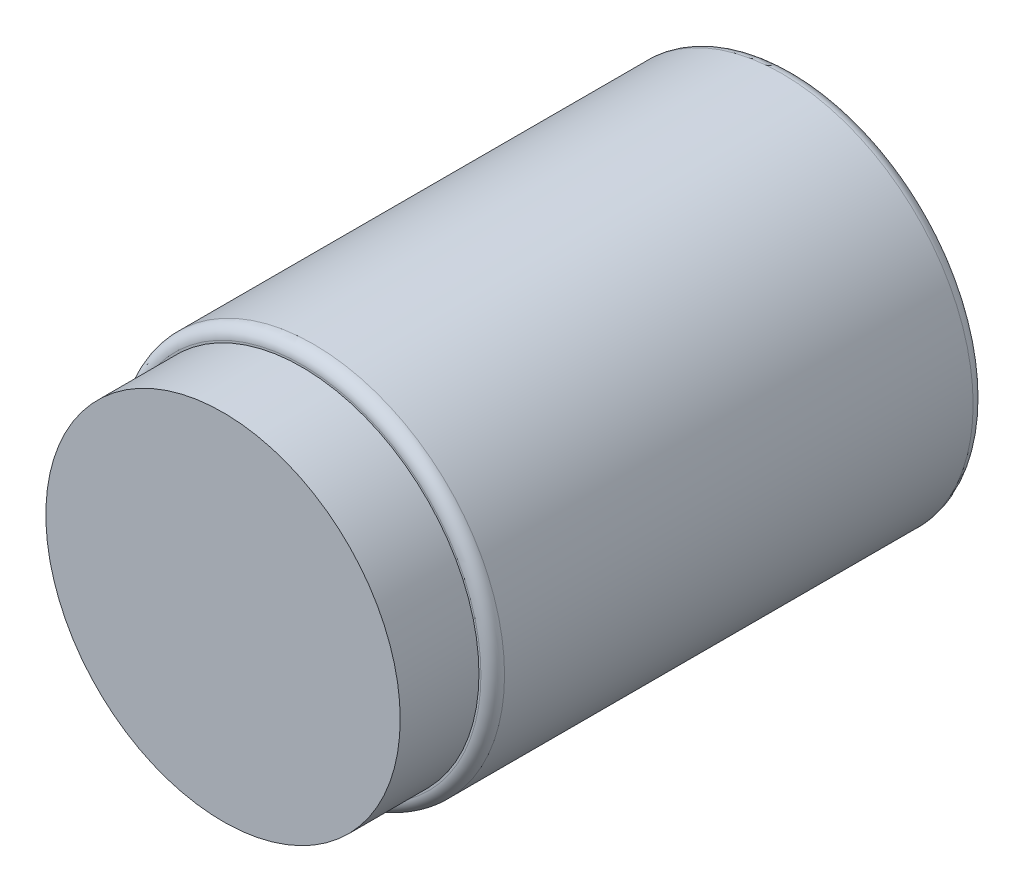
ISO-10303-21;
HEADER;
FILE_DESCRIPTION(('STEP AP214'),'2;1');
FILE_NAME('part.step','',(''),(''),'','','');
FILE_SCHEMA(('AUTOMOTIVE_DESIGN { 1 0 10303 214 1 1 1 1 }'));
ENDSEC;
DATA;
#1=APPLICATION_CONTEXT('core data for automotive mechanical design processes');
#2=APPLICATION_PROTOCOL_DEFINITION('international standard','automotive_design',2000,#1);
#3=PRODUCT_CONTEXT('',#1,'mechanical');
#4=PRODUCT('Part','Part','',(#3));
#5=PRODUCT_RELATED_PRODUCT_CATEGORY('part','',(#4));
#6=PRODUCT_DEFINITION_FORMATION('','',#4);
#7=PRODUCT_DEFINITION_CONTEXT('part definition',#1,'design');
#8=PRODUCT_DEFINITION('design','',#6,#7);
#9=PRODUCT_DEFINITION_SHAPE('','',#8);
#10=(LENGTH_UNIT() NAMED_UNIT(*) SI_UNIT(.MILLI.,.METRE.));
#11=(NAMED_UNIT(*) PLANE_ANGLE_UNIT() SI_UNIT($,.RADIAN.));
#12=(NAMED_UNIT(*) SI_UNIT($,.STERADIAN.) SOLID_ANGLE_UNIT());
#13=UNCERTAINTY_MEASURE_WITH_UNIT(LENGTH_MEASURE(1.E-05),#10,'distance_accuracy_value','');
#14=(GEOMETRIC_REPRESENTATION_CONTEXT(3) GLOBAL_UNCERTAINTY_ASSIGNED_CONTEXT((#13)) GLOBAL_UNIT_ASSIGNED_CONTEXT((#10,
#11,#12)) REPRESENTATION_CONTEXT('',''));
#15=CARTESIAN_POINT('',(0.,0.,0.));
#16=DIRECTION('',(0.,0.,1.));
#17=DIRECTION('',(1.,0.,0.));
#18=AXIS2_PLACEMENT_3D('',#15,#16,#17);
#19=CARTESIAN_POINT('',(0.,0.,-5.));
#20=DIRECTION('',(0.,0.,1.));
#21=DIRECTION('',(1.,0.,0.));
#22=AXIS2_PLACEMENT_3D('',#19,#20,#21);
#23=CYLINDRICAL_SURFACE('',#22,15.);
#24=CARTESIAN_POINT('',(0.,0.,-15.));
#25=DIRECTION('',(0.,-0.707106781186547,0.707106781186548));
#26=DIRECTION('',(0.,0.707106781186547,0.707106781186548));
#27=AXIS2_PLACEMENT_3D('',#24,#25,#26);
#28=ELLIPSE('',#27,21.2132034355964,15.);
#29=CARTESIAN_POINT('',(-11.1803398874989,10.,-5.));
#30=VERTEX_POINT('',#29);
#31=CARTESIAN_POINT('',(0.,15.,0.));
#32=VERTEX_POINT('',#31);
#33=EDGE_CURVE('E65',#30,#32,#28,.F.);
#34=ORIENTED_EDGE('',*,*,#33,.F.);
#35=CARTESIAN_POINT('',(0.,0.,-5.));
#36=DIRECTION('',(0.,0.,-1.));
#37=DIRECTION('',(-1.,0.,0.));
#38=AXIS2_PLACEMENT_3D('',#35,#36,#37);
#39=CIRCLE('',#38,15.);
#40=CARTESIAN_POINT('',(-11.1803398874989,-10.,-5.));
#41=VERTEX_POINT('',#40);
#42=EDGE_CURVE('E72',#41,#30,#39,.T.);
#43=ORIENTED_EDGE('',*,*,#42,.F.);
#44=CARTESIAN_POINT('',(0.,0.,-15.));
#45=DIRECTION('',(0.,0.707106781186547,0.707106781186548));
#46=DIRECTION('',(0.,-0.707106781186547,0.707106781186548));
#47=AXIS2_PLACEMENT_3D('',#44,#45,#46);
#48=ELLIPSE('',#47,21.2132034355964,15.);
#49=CARTESIAN_POINT('',(0.,-15.,0.));
#50=VERTEX_POINT('',#49);
#51=EDGE_CURVE('E48',#50,#41,#48,.F.);
#52=ORIENTED_EDGE('',*,*,#51,.F.);
#53=CARTESIAN_POINT('',(0.,0.,0.));
#54=DIRECTION('',(0.,0.,1.));
#55=DIRECTION('',(1.,0.,0.));
#56=AXIS2_PLACEMENT_3D('',#53,#54,#55);
#57=CIRCLE('',#56,15.);
#58=EDGE_CURVE('E69',#50,#32,#57,.F.);
#59=ORIENTED_EDGE('',*,*,#58,.T.);
#60=EDGE_LOOP('',(#34,#43,#52,#59));
#61=FACE_BOUND('',#60,.T.);
#62=ADVANCED_FACE('F33',(#61),#23,.T.);
#63=CARTESIAN_POINT('',(11.1803398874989,10.,-5.));
#64=VERTEX_POINT('',#63);
#65=EDGE_CURVE('E55',#32,#64,#28,.F.);
#66=ORIENTED_EDGE('',*,*,#65,.F.);
#67=EDGE_CURVE('E100',#32,#50,#57,.F.);
#68=ORIENTED_EDGE('',*,*,#67,.T.);
#69=CARTESIAN_POINT('',(11.180339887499,-9.99999999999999,-5.));
#70=VERTEX_POINT('',#69);
#71=EDGE_CURVE('E74',#70,#50,#48,.F.);
#72=ORIENTED_EDGE('',*,*,#71,.F.);
#73=EDGE_CURVE('E77',#64,#70,#39,.T.);
#74=ORIENTED_EDGE('',*,*,#73,.F.);
#75=EDGE_LOOP('',(#66,#68,#72,#74));
#76=FACE_BOUND('',#75,.T.);
#77=ADVANCED_FACE('F105',(#76),#23,.T.);
#78=CARTESIAN_POINT('',(0.,0.,-5.));
#79=DIRECTION('',(0.,0.,-1.));
#80=DIRECTION('',(-1.,0.,0.));
#81=AXIS2_PLACEMENT_3D('',#78,#79,#80);
#82=PLANE('',#81);
#83=ORIENTED_EDGE('',*,*,#73,.T.);
#84=DIRECTION('',(0.,-1.,0.));
#85=VECTOR('',#84,1.);
#86=CARTESIAN_POINT('',(11.1803398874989,48.5,-5.));
#87=LINE('',#86,#85);
#88=EDGE_CURVE('E11',#70,#64,#87,.F.);
#89=ORIENTED_EDGE('',*,*,#88,.T.);
#90=EDGE_LOOP('',(#83,#89));
#91=FACE_BOUND('',#90,.T.);
#92=ADVANCED_FACE('F139',(#91),#82,.T.);
#93=ORIENTED_EDGE('',*,*,#42,.T.);
#94=DIRECTION('',(0.,-1.,0.));
#95=VECTOR('',#94,1.);
#96=CARTESIAN_POINT('',(-11.1803398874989,48.5,-5.));
#97=LINE('',#96,#95);
#98=EDGE_CURVE('E41',#30,#41,#97,.T.);
#99=ORIENTED_EDGE('',*,*,#98,.T.);
#100=EDGE_LOOP('',(#93,#99));
#101=FACE_BOUND('',#100,.T.);
#102=ADVANCED_FACE('F76',(#101),#82,.T.);
#103=CARTESIAN_POINT('',(0.,0.,0.));
#104=DIRECTION('',(0.,0.,1.));
#105=DIRECTION('',(1.,0.,0.));
#106=AXIS2_PLACEMENT_3D('',#103,#104,#105);
#107=PLANE('',#106);
#108=ORIENTED_EDGE('',*,*,#58,.F.);
#109=ORIENTED_EDGE('',*,*,#67,.F.);
#110=EDGE_LOOP('',(#108,#109));
#111=FACE_BOUND('',#110,.T.);
#112=CARTESIAN_POINT('',(0.,0.,0.));
#113=DIRECTION('',(0.,0.,1.));
#114=DIRECTION('',(1.,0.,0.));
#115=AXIS2_PLACEMENT_3D('',#112,#113,#114);
#116=CIRCLE('',#115,45.5);
#117=CARTESIAN_POINT('',(45.5,0.,0.));
#118=VERTEX_POINT('',#117);
#119=EDGE_CURVE('E91',#118,#118,#116,.F.);
#120=ORIENTED_EDGE('',*,*,#119,.T.);
#121=EDGE_LOOP('',(#120));
#122=FACE_BOUND('',#121,.T.);
#123=ADVANCED_FACE('F108',(#111,#122),#107,.F.);
#124=CARTESIAN_POINT('',(0.,0.,125.));
#125=DIRECTION('',(0.,0.,1.));
#126=DIRECTION('',(1.,0.,0.));
#127=AXIS2_PLACEMENT_3D('',#124,#125,#126);
#128=PLANE('',#127);
#129=CARTESIAN_POINT('',(0.,0.,125.));
#130=DIRECTION('',(0.,0.,1.));
#131=DIRECTION('',(1.,0.,0.));
#132=AXIS2_PLACEMENT_3D('',#129,#130,#131);
#133=CIRCLE('',#132,45.5);
#134=CARTESIAN_POINT('',(45.5,0.,125.));
#135=VERTEX_POINT('',#134);
#136=EDGE_CURVE('E94',#135,#135,#133,.T.);
#137=ORIENTED_EDGE('',*,*,#136,.T.);
#138=EDGE_LOOP('',(#137));
#139=FACE_BOUND('',#138,.T.);
#140=CARTESIAN_POINT('',(0.,0.,125.));
#141=DIRECTION('',(0.,0.,1.));
#142=DIRECTION('',(1.,0.,0.));
#143=AXIS2_PLACEMENT_3D('',#140,#141,#142);
#144=CIRCLE('',#143,45.);
#145=CARTESIAN_POINT('',(45.,0.,125.));
#146=VERTEX_POINT('',#145);
#147=EDGE_CURVE('E80',#146,#146,#144,.T.);
#148=ORIENTED_EDGE('',*,*,#147,.F.);
#149=EDGE_LOOP('',(#148));
#150=FACE_BOUND('',#149,.T.);
#151=ADVANCED_FACE('F111',(#139,#150),#128,.T.);
#152=CARTESIAN_POINT('',(0.,0.,125.));
#153=DIRECTION('',(0.,0.,-1.));
#154=DIRECTION('',(-1.,0.,0.));
#155=AXIS2_PLACEMENT_3D('',#152,#153,#154);
#156=CYLINDRICAL_SURFACE('',#155,48.5);
#157=CARTESIAN_POINT('',(0.,0.,122.));
#158=DIRECTION('',(0.,0.,1.));
#159=DIRECTION('',(1.,0.,0.));
#160=AXIS2_PLACEMENT_3D('',#157,#158,#159);
#161=CIRCLE('',#160,48.5);
#162=CARTESIAN_POINT('',(48.5,0.,122.));
#163=VERTEX_POINT('',#162);
#164=EDGE_CURVE('E97',#163,#163,#161,.F.);
#165=ORIENTED_EDGE('',*,*,#164,.T.);
#166=EDGE_LOOP('',(#165));
#167=FACE_BOUND('',#166,.T.);
#168=CARTESIAN_POINT('',(0.,0.,3.));
#169=DIRECTION('',(0.,0.,1.));
#170=DIRECTION('',(1.,0.,0.));
#171=AXIS2_PLACEMENT_3D('',#168,#169,#170);
#172=CIRCLE('',#171,48.5);
#173=CARTESIAN_POINT('',(48.5,0.,3.));
#174=VERTEX_POINT('',#173);
#175=EDGE_CURVE('E86',#174,#174,#172,.T.);
#176=ORIENTED_EDGE('',*,*,#175,.T.);
#177=EDGE_LOOP('',(#176));
#178=FACE_BOUND('',#177,.T.);
#179=ADVANCED_FACE('F121',(#167,#178),#156,.T.);
#180=CARTESIAN_POINT('',(0.,0.,145.));
#181=DIRECTION('',(0.,0.,-1.));
#182=DIRECTION('',(-1.,0.,0.));
#183=AXIS2_PLACEMENT_3D('',#180,#181,#182);
#184=CYLINDRICAL_SURFACE('',#183,45.);
#185=CARTESIAN_POINT('',(0.,0.,145.));
#186=DIRECTION('',(0.,0.,1.));
#187=DIRECTION('',(1.,0.,0.));
#188=AXIS2_PLACEMENT_3D('',#185,#186,#187);
#189=CIRCLE('',#188,45.);
#190=CARTESIAN_POINT('',(45.,0.,145.));
#191=VERTEX_POINT('',#190);
#192=EDGE_CURVE('E83',#191,#191,#189,.T.);
#193=ORIENTED_EDGE('',*,*,#192,.F.);
#194=EDGE_LOOP('',(#193));
#195=FACE_BOUND('',#194,.T.);
#196=ORIENTED_EDGE('',*,*,#147,.T.);
#197=EDGE_LOOP('',(#196));
#198=FACE_BOUND('',#197,.T.);
#199=ADVANCED_FACE('F123',(#195,#198),#184,.T.);
#200=CARTESIAN_POINT('',(0.,0.,145.));
#201=DIRECTION('',(0.,0.,1.));
#202=DIRECTION('',(1.,0.,0.));
#203=AXIS2_PLACEMENT_3D('',#200,#201,#202);
#204=PLANE('',#203);
#205=ORIENTED_EDGE('',*,*,#192,.T.);
#206=EDGE_LOOP('',(#205));
#207=FACE_BOUND('',#206,.T.);
#208=ADVANCED_FACE('F118',(#207),#204,.T.);
#209=CARTESIAN_POINT('',(0.,0.,3.));
#210=DIRECTION('',(0.,0.,1.));
#211=DIRECTION('',(1.,0.,0.));
#212=AXIS2_PLACEMENT_3D('',#209,#210,#211);
#213=TOROIDAL_SURFACE('',#212,45.5,3.);
#214=ORIENTED_EDGE('',*,*,#119,.F.);
#215=EDGE_LOOP('',(#214));
#216=FACE_BOUND('',#215,.T.);
#217=ORIENTED_EDGE('',*,*,#175,.F.);
#218=EDGE_LOOP('',(#217));
#219=FACE_BOUND('',#218,.T.);
#220=ADVANCED_FACE('F115',(#216,#219),#213,.T.);
#221=CARTESIAN_POINT('',(0.,0.,122.));
#222=DIRECTION('',(0.,0.,1.));
#223=DIRECTION('',(1.,0.,0.));
#224=AXIS2_PLACEMENT_3D('',#221,#222,#223);
#225=TOROIDAL_SURFACE('',#224,45.5,3.);
#226=ORIENTED_EDGE('',*,*,#164,.F.);
#227=EDGE_LOOP('',(#226));
#228=FACE_BOUND('',#227,.T.);
#229=ORIENTED_EDGE('',*,*,#136,.F.);
#230=EDGE_LOOP('',(#229));
#231=FACE_BOUND('',#230,.T.);
#232=ADVANCED_FACE('F35',(#228,#231),#225,.T.);
#233=CARTESIAN_POINT('',(0.,48.5,-15.));
#234=DIRECTION('',(0.,-1.,0.));
#235=DIRECTION('',(0.,0.,-1.));
#236=AXIS2_PLACEMENT_3D('',#233,#234,#235);
#237=CYLINDRICAL_SURFACE('',#236,15.);
#238=ORIENTED_EDGE('',*,*,#65,.T.);
#239=ORIENTED_EDGE('',*,*,#88,.F.);
#240=ORIENTED_EDGE('',*,*,#71,.T.);
#241=ORIENTED_EDGE('',*,*,#51,.T.);
#242=ORIENTED_EDGE('',*,*,#98,.F.);
#243=ORIENTED_EDGE('',*,*,#33,.T.);
#244=EDGE_LOOP('',(#238,#239,#240,#241,#242,#243));
#245=FACE_BOUND('',#244,.T.);
#246=ADVANCED_FACE('F64',(#245),#237,.F.);
#247=CLOSED_SHELL('',(#62,#77,#92,#102,#123,#151,#179,#199,#208,#220,#232,#246));
#248=MANIFOLD_SOLID_BREP('B2',#247);
#249=ADVANCED_BREP_SHAPE_REPRESENTATION('',(#18,#248),#14);
#250=SHAPE_DEFINITION_REPRESENTATION(#9,#249);
ENDSEC;
END-ISO-10303-21;
